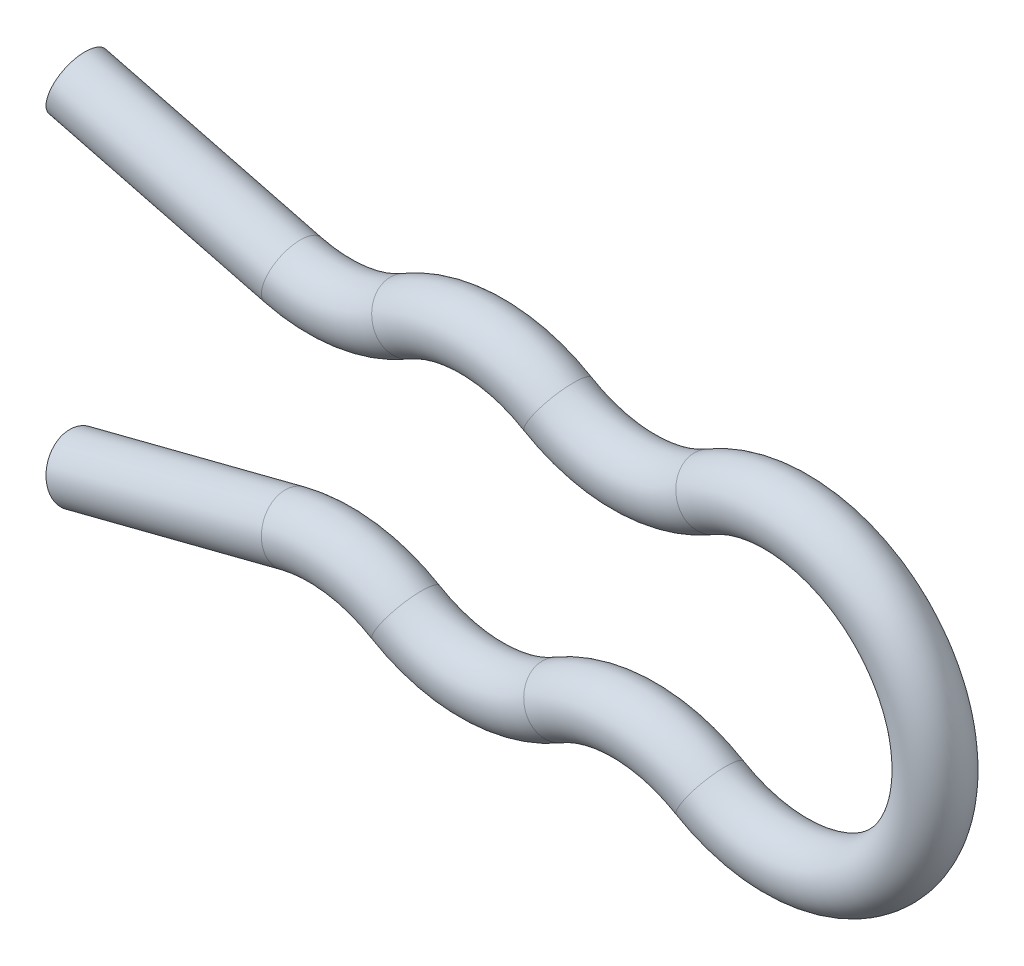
ISO-10303-21;
HEADER;
FILE_DESCRIPTION(('STEP AP214'),'2;1');
FILE_NAME('part.step','',(''),(''),'','','');
FILE_SCHEMA(('AUTOMOTIVE_DESIGN { 1 0 10303 214 1 1 1 1 }'));
ENDSEC;
DATA;
#1=APPLICATION_CONTEXT('core data for automotive mechanical design processes');
#2=APPLICATION_PROTOCOL_DEFINITION('international standard','automotive_design',2000,#1);
#3=PRODUCT_CONTEXT('',#1,'mechanical');
#4=PRODUCT('Part','Part','',(#3));
#5=PRODUCT_RELATED_PRODUCT_CATEGORY('part','',(#4));
#6=PRODUCT_DEFINITION_FORMATION('','',#4);
#7=PRODUCT_DEFINITION_CONTEXT('part definition',#1,'design');
#8=PRODUCT_DEFINITION('design','',#6,#7);
#9=PRODUCT_DEFINITION_SHAPE('','',#8);
#10=(LENGTH_UNIT() NAMED_UNIT(*) SI_UNIT(.MILLI.,.METRE.));
#11=(NAMED_UNIT(*) PLANE_ANGLE_UNIT() SI_UNIT($,.RADIAN.));
#12=(NAMED_UNIT(*) SI_UNIT($,.STERADIAN.) SOLID_ANGLE_UNIT());
#13=UNCERTAINTY_MEASURE_WITH_UNIT(LENGTH_MEASURE(1.E-05),#10,'distance_accuracy_value','');
#14=(GEOMETRIC_REPRESENTATION_CONTEXT(3) GLOBAL_UNCERTAINTY_ASSIGNED_CONTEXT((#13)) GLOBAL_UNIT_ASSIGNED_CONTEXT((#10,
#11,#12)) REPRESENTATION_CONTEXT('',''));
#15=CARTESIAN_POINT('',(0.,0.,0.));
#16=DIRECTION('',(0.,0.,1.));
#17=DIRECTION('',(1.,0.,0.));
#18=AXIS2_PLACEMENT_3D('',#15,#16,#17);
#19=CARTESIAN_POINT('',(-8.10908115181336,1.84117908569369,0.));
#20=DIRECTION('',(-0.968605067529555,0.248604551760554,0.));
#21=DIRECTION('',(-0.248604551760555,-0.968605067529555,0.));
#22=AXIS2_PLACEMENT_3D('',#19,#20,#21);
#23=CYLINDRICAL_SURFACE('',#22,0.5);
#24=DIRECTION('',(-0.968605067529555,0.248604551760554,0.));
#25=VECTOR('',#24,1.);
#26=CARTESIAN_POINT('',(-8.10122351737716,1.87179374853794,-0.499));
#27=LINE('',#26,#25);
#28=CARTESIAN_POINT('',(-11.6421423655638,2.78061466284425,-0.499));
#29=VERTEX_POINT('',#28);
#30=CARTESIAN_POINT('',(-8.10122351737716,1.87179374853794,-0.499));
#31=VERTEX_POINT('',#30);
#32=EDGE_CURVE('E69',#29,#31,#27,.F.);
#33=ORIENTED_EDGE('',*,*,#32,.F.);
#34=CARTESIAN_POINT('',(-11.65,2.75,0.));
#35=DIRECTION('',(-0.968605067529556,0.248604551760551,0.));
#36=DIRECTION('',(0.,0.,1.));
#37=AXIS2_PLACEMENT_3D('',#34,#35,#36);
#38=CIRCLE('',#37,0.5);
#39=CARTESIAN_POINT('',(-11.6578576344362,2.71938533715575,-0.499));
#40=VERTEX_POINT('',#39);
#41=EDGE_CURVE('E40',#40,#29,#38,.T.);
#42=ORIENTED_EDGE('',*,*,#41,.F.);
#43=DIRECTION('',(-0.968605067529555,0.248604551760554,0.));
#44=VECTOR('',#43,1.);
#45=CARTESIAN_POINT('',(-8.11693878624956,1.81056442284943,-0.499));
#46=LINE('',#45,#44);
#47=CARTESIAN_POINT('',(-8.11693878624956,1.81056442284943,-0.499));
#48=VERTEX_POINT('',#47);
#49=EDGE_CURVE('E59',#48,#40,#46,.T.);
#50=ORIENTED_EDGE('',*,*,#49,.F.);
#51=CARTESIAN_POINT('',(-8.10908115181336,1.84117908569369,0.));
#52=DIRECTION('',(-0.968605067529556,0.248604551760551,0.));
#53=DIRECTION('',(0.,0.,1.));
#54=AXIS2_PLACEMENT_3D('',#51,#52,#53);
#55=CIRCLE('',#54,0.5);
#56=EDGE_CURVE('E147',#48,#31,#55,.T.);
#57=ORIENTED_EDGE('',*,*,#56,.T.);
#58=EDGE_LOOP('',(#33,#42,#50,#57));
#59=FACE_BOUND('',#58,.T.);
#60=ADVANCED_FACE('F31',(#59),#23,.T.);
#61=CARTESIAN_POINT('',(-7.5,4.2142615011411,0.));
#62=DIRECTION('',(0.,0.,-1.));
#63=DIRECTION('',(-1.,0.,0.));
#64=AXIS2_PLACEMENT_3D('',#61,#62,#63);
#65=TOROIDAL_SURFACE('',#64,2.45,0.5);
#66=CARTESIAN_POINT('',(-7.5,4.2142615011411,-0.498999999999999));
#67=DIRECTION('',(0.,0.,1.));
#68=DIRECTION('',(0.,-1.,0.));
#69=AXIS2_PLACEMENT_3D('',#66,#67,#68);
#70=CIRCLE('',#69,2.48160696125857);
#71=CARTESIAN_POINT('',(-6.23387399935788,2.07994707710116,-0.499));
#72=VERTEX_POINT('',#71);
#73=EDGE_CURVE('E64',#72,#48,#70,.F.);
#74=ORIENTED_EDGE('',*,*,#73,.F.);
#75=CARTESIAN_POINT('',(-6.25,2.10713075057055,0.));
#76=DIRECTION('',(-0.860053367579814,-0.510204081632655,0.));
#77=DIRECTION('',(0.,0.,1.));
#78=AXIS2_PLACEMENT_3D('',#75,#76,#77);
#79=CIRCLE('',#78,0.5);
#80=CARTESIAN_POINT('',(-6.26612600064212,2.13431442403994,-0.498999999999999));
#81=VERTEX_POINT('',#80);
#82=EDGE_CURVE('E144',#72,#81,#79,.T.);
#83=ORIENTED_EDGE('',*,*,#82,.T.);
#84=CARTESIAN_POINT('',(-7.5,4.2142615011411,-0.498999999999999));
#85=DIRECTION('',(0.,0.,-1.));
#86=DIRECTION('',(0.,1.,0.));
#87=AXIS2_PLACEMENT_3D('',#84,#85,#86);
#88=CIRCLE('',#87,2.41839303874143);
#89=EDGE_CURVE('E195',#31,#81,#88,.F.);
#90=ORIENTED_EDGE('',*,*,#89,.F.);
#91=ORIENTED_EDGE('',*,*,#56,.F.);
#92=EDGE_LOOP('',(#74,#83,#90,#91));
#93=FACE_BOUND('',#92,.T.);
#94=ADVANCED_FACE('F204',(#93),#65,.T.);
#95=CARTESIAN_POINT('',(-5.,0.,0.));
#96=DIRECTION('',(0.,0.,1.));
#97=DIRECTION('',(1.,0.,0.));
#98=AXIS2_PLACEMENT_3D('',#95,#96,#97);
#99=TOROIDAL_SURFACE('',#98,2.45,0.5);
#100=CARTESIAN_POINT('',(-5.,0.,-0.499));
#101=DIRECTION('',(0.,0.,1.));
#102=DIRECTION('',(0.,-1.,0.));
#103=AXIS2_PLACEMENT_3D('',#100,#101,#102);
#104=CIRCLE('',#103,2.48160696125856);
#105=CARTESIAN_POINT('',(-3.73387399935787,2.13431442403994,-0.498999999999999));
#106=VERTEX_POINT('',#105);
#107=EDGE_CURVE('E193',#81,#106,#104,.F.);
#108=ORIENTED_EDGE('',*,*,#107,.F.);
#109=ORIENTED_EDGE('',*,*,#82,.F.);
#110=CARTESIAN_POINT('',(-5.,0.,-0.499));
#111=DIRECTION('',(0.,0.,-1.));
#112=DIRECTION('',(0.,1.,0.));
#113=AXIS2_PLACEMENT_3D('',#110,#111,#112);
#114=CIRCLE('',#113,2.41839303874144);
#115=CARTESIAN_POINT('',(-3.76612600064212,2.07994707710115,-0.499));
#116=VERTEX_POINT('',#115);
#117=EDGE_CURVE('E191',#116,#72,#114,.F.);
#118=ORIENTED_EDGE('',*,*,#117,.F.);
#119=CARTESIAN_POINT('',(-3.75,2.10713075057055,0.));
#120=DIRECTION('',(-0.860053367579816,0.510204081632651,0.));
#121=DIRECTION('',(0.,0.,1.));
#122=AXIS2_PLACEMENT_3D('',#119,#120,#121);
#123=CIRCLE('',#122,0.5);
#124=EDGE_CURVE('E141',#116,#106,#123,.T.);
#125=ORIENTED_EDGE('',*,*,#124,.T.);
#126=EDGE_LOOP('',(#108,#109,#118,#125));
#127=FACE_BOUND('',#126,.T.);
#128=ADVANCED_FACE('F201',(#127),#99,.T.);
#129=CARTESIAN_POINT('',(-2.5,4.2142615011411,0.));
#130=DIRECTION('',(0.,0.,-1.));
#131=DIRECTION('',(-1.,0.,0.));
#132=AXIS2_PLACEMENT_3D('',#129,#130,#131);
#133=TOROIDAL_SURFACE('',#132,2.45,0.5);
#134=CARTESIAN_POINT('',(-2.5,4.2142615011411,-0.498999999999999));
#135=DIRECTION('',(0.,0.,1.));
#136=DIRECTION('',(0.,-1.,0.));
#137=AXIS2_PLACEMENT_3D('',#134,#135,#136);
#138=CIRCLE('',#137,2.48160696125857);
#139=CARTESIAN_POINT('',(-1.23387399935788,2.07994707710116,-0.499));
#140=VERTEX_POINT('',#139);
#141=EDGE_CURVE('E189',#140,#116,#138,.F.);
#142=ORIENTED_EDGE('',*,*,#141,.F.);
#143=CARTESIAN_POINT('',(-1.25,2.10713075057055,0.));
#144=DIRECTION('',(-0.860053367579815,-0.510204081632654,0.));
#145=DIRECTION('',(0.,0.,1.));
#146=AXIS2_PLACEMENT_3D('',#143,#144,#145);
#147=CIRCLE('',#146,0.5);
#148=CARTESIAN_POINT('',(-1.26612600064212,2.13431442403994,-0.498999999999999));
#149=VERTEX_POINT('',#148);
#150=EDGE_CURVE('E133',#140,#149,#147,.T.);
#151=ORIENTED_EDGE('',*,*,#150,.T.);
#152=CARTESIAN_POINT('',(-2.5,4.2142615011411,-0.498999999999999));
#153=DIRECTION('',(0.,0.,-1.));
#154=DIRECTION('',(0.,1.,0.));
#155=AXIS2_PLACEMENT_3D('',#152,#153,#154);
#156=CIRCLE('',#155,2.41839303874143);
#157=EDGE_CURVE('E187',#106,#149,#156,.F.);
#158=ORIENTED_EDGE('',*,*,#157,.F.);
#159=ORIENTED_EDGE('',*,*,#124,.F.);
#160=EDGE_LOOP('',(#142,#151,#158,#159));
#161=FACE_BOUND('',#160,.T.);
#162=ADVANCED_FACE('F210',(#161),#133,.T.);
#163=CARTESIAN_POINT('',(0.,0.,0.));
#164=DIRECTION('',(0.,0.,-1.));
#165=DIRECTION('',(-1.,0.,0.));
#166=AXIS2_PLACEMENT_3D('',#163,#164,#165);
#167=TOROIDAL_SURFACE('',#166,2.45,0.5);
#168=CARTESIAN_POINT('',(-1.25,-2.10713075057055,0.));
#169=DIRECTION('',(0.860053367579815,-0.510204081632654,0.));
#170=DIRECTION('',(0.,0.,1.));
#171=AXIS2_PLACEMENT_3D('',#168,#169,#170);
#172=CIRCLE('',#171,0.5);
#173=CARTESIAN_POINT('',(-1.23387399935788,-2.07994707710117,-0.499));
#174=VERTEX_POINT('',#173);
#175=CARTESIAN_POINT('',(-1.26612600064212,-2.13431442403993,-0.499));
#176=VERTEX_POINT('',#175);
#177=EDGE_CURVE('E157',#174,#176,#172,.T.);
#178=ORIENTED_EDGE('',*,*,#177,.T.);
#179=CARTESIAN_POINT('',(0.,0.,-0.499));
#180=DIRECTION('',(0.,0.,1.));
#181=DIRECTION('',(0.,-1.,0.));
#182=AXIS2_PLACEMENT_3D('',#179,#180,#181);
#183=CIRCLE('',#182,2.48160696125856);
#184=EDGE_CURVE('E184',#176,#149,#183,.T.);
#185=ORIENTED_EDGE('',*,*,#184,.T.);
#186=ORIENTED_EDGE('',*,*,#150,.F.);
#187=CARTESIAN_POINT('',(0.,0.,-0.499));
#188=DIRECTION('',(0.,0.,-1.));
#189=DIRECTION('',(0.,1.,0.));
#190=AXIS2_PLACEMENT_3D('',#187,#188,#189);
#191=CIRCLE('',#190,2.41839303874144);
#192=EDGE_CURVE('E181',#140,#174,#191,.T.);
#193=ORIENTED_EDGE('',*,*,#192,.T.);
#194=EDGE_LOOP('',(#178,#185,#186,#193));
#195=FACE_BOUND('',#194,.T.);
#196=ADVANCED_FACE('F215',(#195),#167,.T.);
#197=CARTESIAN_POINT('',(-11.65,2.75,0.));
#198=DIRECTION('',(-0.968605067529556,0.248604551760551,0.));
#199=DIRECTION('',(0.,0.,1.));
#200=AXIS2_PLACEMENT_3D('',#197,#198,#199);
#201=PLANE('',#200);
#202=DIRECTION('',(0.248604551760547,0.968605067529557,0.));
#203=VECTOR('',#202,1.);
#204=CARTESIAN_POINT('',(-11.6578576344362,2.71938533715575,-0.499));
#205=LINE('',#204,#203);
#206=EDGE_CURVE('E34',#40,#29,#205,.T.);
#207=ORIENTED_EDGE('',*,*,#206,.F.);
#208=ORIENTED_EDGE('',*,*,#41,.T.);
#209=EDGE_LOOP('',(#207,#208));
#210=FACE_BOUND('',#209,.T.);
#211=ADVANCED_FACE('F153',(#210),#201,.T.);
#212=CARTESIAN_POINT('',(-8.10908115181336,-1.84117908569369,0.));
#213=DIRECTION('',(-0.968605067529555,-0.248604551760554,0.));
#214=DIRECTION('',(0.248604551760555,-0.968605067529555,0.));
#215=AXIS2_PLACEMENT_3D('',#212,#213,#214);
#216=CYLINDRICAL_SURFACE('',#215,0.5);
#217=CARTESIAN_POINT('',(-8.10908115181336,-1.84117908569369,0.));
#218=DIRECTION('',(0.968605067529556,0.248604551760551,0.));
#219=DIRECTION('',(0.,0.,1.));
#220=AXIS2_PLACEMENT_3D('',#217,#218,#219);
#221=CIRCLE('',#220,0.5);
#222=CARTESIAN_POINT('',(-8.11693878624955,-1.81056442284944,-0.499));
#223=VERTEX_POINT('',#222);
#224=CARTESIAN_POINT('',(-8.10122351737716,-1.87179374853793,-0.499));
#225=VERTEX_POINT('',#224);
#226=EDGE_CURVE('E125',#223,#225,#221,.T.);
#227=ORIENTED_EDGE('',*,*,#226,.F.);
#228=DIRECTION('',(-0.968605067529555,-0.248604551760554,0.));
#229=VECTOR('',#228,1.);
#230=CARTESIAN_POINT('',(-8.11693878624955,-1.81056442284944,-0.499));
#231=LINE('',#230,#229);
#232=CARTESIAN_POINT('',(-11.6578576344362,-2.71938533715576,-0.499));
#233=VERTEX_POINT('',#232);
#234=EDGE_CURVE('E118',#223,#233,#231,.T.);
#235=ORIENTED_EDGE('',*,*,#234,.T.);
#236=CARTESIAN_POINT('',(-11.65,-2.75,0.));
#237=DIRECTION('',(0.968605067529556,0.248604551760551,0.));
#238=DIRECTION('',(0.,0.,1.));
#239=AXIS2_PLACEMENT_3D('',#236,#237,#238);
#240=CIRCLE('',#239,0.5);
#241=CARTESIAN_POINT('',(-11.6421423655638,-2.78061466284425,-0.499));
#242=VERTEX_POINT('',#241);
#243=EDGE_CURVE('E127',#233,#242,#240,.T.);
#244=ORIENTED_EDGE('',*,*,#243,.T.);
#245=DIRECTION('',(-0.968605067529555,-0.248604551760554,0.));
#246=VECTOR('',#245,1.);
#247=CARTESIAN_POINT('',(-8.10122351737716,-1.87179374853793,-0.499));
#248=LINE('',#247,#246);
#249=EDGE_CURVE('E46',#242,#225,#248,.F.);
#250=ORIENTED_EDGE('',*,*,#249,.T.);
#251=EDGE_LOOP('',(#227,#235,#244,#250));
#252=FACE_BOUND('',#251,.T.);
#253=ADVANCED_FACE('F123',(#252),#216,.T.);
#254=CARTESIAN_POINT('',(-7.5,-4.2142615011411,0.));
#255=DIRECTION('',(0.,0.,1.));
#256=DIRECTION('',(1.,0.,0.));
#257=AXIS2_PLACEMENT_3D('',#254,#255,#256);
#258=TOROIDAL_SURFACE('',#257,2.45,0.5);
#259=CARTESIAN_POINT('',(-6.25,-2.10713075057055,0.));
#260=DIRECTION('',(0.860053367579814,-0.510204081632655,0.));
#261=DIRECTION('',(0.,0.,1.));
#262=AXIS2_PLACEMENT_3D('',#259,#260,#261);
#263=CIRCLE('',#262,0.5);
#264=CARTESIAN_POINT('',(-6.23387399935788,-2.07994707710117,-0.499));
#265=VERTEX_POINT('',#264);
#266=CARTESIAN_POINT('',(-6.26612600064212,-2.13431442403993,-0.499));
#267=VERTEX_POINT('',#266);
#268=EDGE_CURVE('E131',#265,#267,#263,.T.);
#269=ORIENTED_EDGE('',*,*,#268,.F.);
#270=CARTESIAN_POINT('',(-7.5,-4.2142615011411,-0.499));
#271=DIRECTION('',(0.,0.,1.));
#272=DIRECTION('',(0.,-1.,0.));
#273=AXIS2_PLACEMENT_3D('',#270,#271,#272);
#274=CIRCLE('',#273,2.48160696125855);
#275=EDGE_CURVE('E117',#265,#223,#274,.T.);
#276=ORIENTED_EDGE('',*,*,#275,.T.);
#277=ORIENTED_EDGE('',*,*,#226,.T.);
#278=CARTESIAN_POINT('',(-7.5,-4.2142615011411,-0.499));
#279=DIRECTION('',(0.,0.,-1.));
#280=DIRECTION('',(0.,1.,0.));
#281=AXIS2_PLACEMENT_3D('',#278,#279,#280);
#282=CIRCLE('',#281,2.41839303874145);
#283=EDGE_CURVE('E109',#225,#267,#282,.T.);
#284=ORIENTED_EDGE('',*,*,#283,.T.);
#285=EDGE_LOOP('',(#269,#276,#277,#284));
#286=FACE_BOUND('',#285,.T.);
#287=ADVANCED_FACE('F130',(#286),#258,.T.);
#288=CARTESIAN_POINT('',(-5.,0.,0.));
#289=DIRECTION('',(0.,0.,-1.));
#290=DIRECTION('',(-1.,0.,0.));
#291=AXIS2_PLACEMENT_3D('',#288,#289,#290);
#292=TOROIDAL_SURFACE('',#291,2.45,0.5);
#293=ORIENTED_EDGE('',*,*,#268,.T.);
#294=CARTESIAN_POINT('',(-5.,0.,-0.499));
#295=DIRECTION('',(0.,0.,1.));
#296=DIRECTION('',(0.,-1.,0.));
#297=AXIS2_PLACEMENT_3D('',#294,#295,#296);
#298=CIRCLE('',#297,2.48160696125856);
#299=CARTESIAN_POINT('',(-3.73387399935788,-2.13431442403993,-0.499));
#300=VERTEX_POINT('',#299);
#301=EDGE_CURVE('E112',#267,#300,#298,.T.);
#302=ORIENTED_EDGE('',*,*,#301,.T.);
#303=CARTESIAN_POINT('',(-3.75,-2.10713075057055,0.));
#304=DIRECTION('',(0.860053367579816,0.510204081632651,0.));
#305=DIRECTION('',(0.,0.,1.));
#306=AXIS2_PLACEMENT_3D('',#303,#304,#305);
#307=CIRCLE('',#306,0.5);
#308=CARTESIAN_POINT('',(-3.76612600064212,-2.07994707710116,-0.499));
#309=VERTEX_POINT('',#308);
#310=EDGE_CURVE('E135',#309,#300,#307,.T.);
#311=ORIENTED_EDGE('',*,*,#310,.F.);
#312=CARTESIAN_POINT('',(-5.,0.,-0.499));
#313=DIRECTION('',(0.,0.,-1.));
#314=DIRECTION('',(0.,1.,0.));
#315=AXIS2_PLACEMENT_3D('',#312,#313,#314);
#316=CIRCLE('',#315,2.41839303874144);
#317=EDGE_CURVE('E174',#309,#265,#316,.T.);
#318=ORIENTED_EDGE('',*,*,#317,.T.);
#319=EDGE_LOOP('',(#293,#302,#311,#318));
#320=FACE_BOUND('',#319,.T.);
#321=ADVANCED_FACE('F173',(#320),#292,.T.);
#322=CARTESIAN_POINT('',(-2.5,-4.2142615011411,0.));
#323=DIRECTION('',(0.,0.,1.));
#324=DIRECTION('',(1.,0.,0.));
#325=AXIS2_PLACEMENT_3D('',#322,#323,#324);
#326=TOROIDAL_SURFACE('',#325,2.45,0.5);
#327=ORIENTED_EDGE('',*,*,#177,.F.);
#328=CARTESIAN_POINT('',(-2.5,-4.2142615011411,-0.499));
#329=DIRECTION('',(0.,0.,1.));
#330=DIRECTION('',(0.,-1.,0.));
#331=AXIS2_PLACEMENT_3D('',#328,#329,#330);
#332=CIRCLE('',#331,2.48160696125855);
#333=EDGE_CURVE('E170',#174,#309,#332,.T.);
#334=ORIENTED_EDGE('',*,*,#333,.T.);
#335=ORIENTED_EDGE('',*,*,#310,.T.);
#336=CARTESIAN_POINT('',(-2.5,-4.2142615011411,-0.499));
#337=DIRECTION('',(0.,0.,-1.));
#338=DIRECTION('',(0.,1.,0.));
#339=AXIS2_PLACEMENT_3D('',#336,#337,#338);
#340=CIRCLE('',#339,2.41839303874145);
#341=EDGE_CURVE('E169',#300,#176,#340,.T.);
#342=ORIENTED_EDGE('',*,*,#341,.T.);
#343=EDGE_LOOP('',(#327,#334,#335,#342));
#344=FACE_BOUND('',#343,.T.);
#345=ADVANCED_FACE('F168',(#344),#326,.T.);
#346=CARTESIAN_POINT('',(-11.65,-2.75,0.));
#347=DIRECTION('',(-0.968605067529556,-0.248604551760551,0.));
#348=DIRECTION('',(0.,0.,1.));
#349=AXIS2_PLACEMENT_3D('',#346,#347,#348);
#350=PLANE('',#349);
#351=DIRECTION('',(-0.248604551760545,0.968605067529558,0.));
#352=VECTOR('',#351,1.);
#353=CARTESIAN_POINT('',(-11.6421423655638,-2.78061466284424,-0.499));
#354=LINE('',#353,#352);
#355=EDGE_CURVE('E11',#242,#233,#354,.T.);
#356=ORIENTED_EDGE('',*,*,#355,.F.);
#357=ORIENTED_EDGE('',*,*,#243,.F.);
#358=EDGE_LOOP('',(#356,#357));
#359=FACE_BOUND('',#358,.T.);
#360=ADVANCED_FACE('F230',(#359),#350,.T.);
#361=CARTESIAN_POINT('',(-30.,3.31404678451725,-0.499));
#362=DIRECTION('',(0.,0.,1.));
#363=DIRECTION('',(0.,-1.,0.));
#364=AXIS2_PLACEMENT_3D('',#361,#362,#363);
#365=PLANE('',#364);
#366=ORIENTED_EDGE('',*,*,#206,.T.);
#367=ORIENTED_EDGE('',*,*,#32,.T.);
#368=ORIENTED_EDGE('',*,*,#89,.T.);
#369=ORIENTED_EDGE('',*,*,#107,.T.);
#370=ORIENTED_EDGE('',*,*,#157,.T.);
#371=ORIENTED_EDGE('',*,*,#184,.F.);
#372=ORIENTED_EDGE('',*,*,#341,.F.);
#373=ORIENTED_EDGE('',*,*,#301,.F.);
#374=ORIENTED_EDGE('',*,*,#283,.F.);
#375=ORIENTED_EDGE('',*,*,#249,.F.);
#376=ORIENTED_EDGE('',*,*,#355,.T.);
#377=ORIENTED_EDGE('',*,*,#234,.F.);
#378=ORIENTED_EDGE('',*,*,#275,.F.);
#379=ORIENTED_EDGE('',*,*,#317,.F.);
#380=ORIENTED_EDGE('',*,*,#333,.F.);
#381=ORIENTED_EDGE('',*,*,#192,.F.);
#382=ORIENTED_EDGE('',*,*,#141,.T.);
#383=ORIENTED_EDGE('',*,*,#117,.T.);
#384=ORIENTED_EDGE('',*,*,#73,.T.);
#385=ORIENTED_EDGE('',*,*,#49,.T.);
#386=EDGE_LOOP('',(#366,#367,#368,#369,#370,#371,#372,#373,#374,#375,#376,#377,#378,#379,#380,
#381,#382,#383,#384,#385));
#387=FACE_BOUND('',#386,.T.);
#388=ADVANCED_FACE('F110',(#387),#365,.F.);
#389=CLOSED_SHELL('',(#60,#94,#128,#162,#196,#211,#253,#287,#321,#345,#360,#388));
#390=MANIFOLD_SOLID_BREP('B2',#389);
#391=ADVANCED_BREP_SHAPE_REPRESENTATION('',(#18,#390),#14);
#392=SHAPE_DEFINITION_REPRESENTATION(#9,#391);
ENDSEC;
END-ISO-10303-21;
